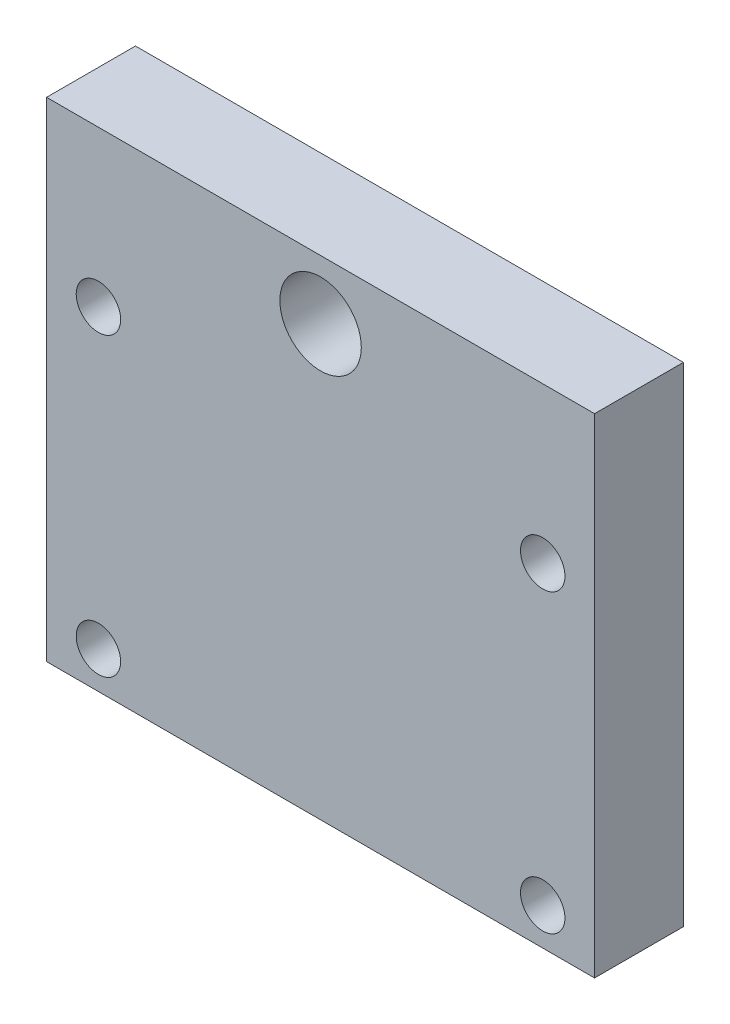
from build123d import *

# Parameters (mm, degrees)
ESQUISSE1_W             = 37
ESQUISSE1_H             = 25
ESQUISSE1_R             = 1.5
EXTRUSION1_DEPTH        = 6
ESQUISSE2_W             = 37
ESQUISSE2_H             = 6
EXTRUSION2_DEPTH        = 8
ESQUISSE3_R             = 2.75
ENL_V_MAT_EXTRU_1_DEPTH = 50.939963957


with BuildPart() as part:
    # Esquisse1 → Extrusion1 (new body)
    with BuildSketch(Plane.XY):
        with Locations((18.5, 12.5)):
            Rectangle(ESQUISSE1_W, ESQUISSE1_H)
        with Locations((3.5, 2.5)):
            Circle(ESQUISSE1_R, mode=Mode.SUBTRACT)
        with Locations(Location((33.5, 2.5, 0), (0, 0, 180))):
            Circle(ESQUISSE1_R, mode=Mode.SUBTRACT)
        with Locations((33.5, 22.5)):
            Circle(ESQUISSE1_R, mode=Mode.SUBTRACT)
        with Locations(Location((3.5, 22.5, 0), (0, 0, 180))):
            Circle(ESQUISSE1_R, mode=Mode.SUBTRACT)
    extrude(amount=EXTRUSION1_DEPTH)

    # Esquisse2 → Extrusion2 (add)
    with BuildSketch(Plane(origin=(0, 25, 0), x_dir=(-1, 0, 0), z_dir=(0, 1, 0))):
        with Locations((-18.5, 3)):
            Rectangle(ESQUISSE2_W, ESQUISSE2_H)
    extrude(amount=EXTRUSION2_DEPTH)

    # Esquisse3 → Enl_v. mat.-Extru.1 (cut, through all)
    with BuildSketch(Plane.XY.offset(6)):
        with Locations((18.5, 29)):
            Circle(ESQUISSE3_R)
    extrude(amount=-ENL_V_MAT_EXTRU_1_DEPTH, mode=Mode.SUBTRACT)


solid = part.part
